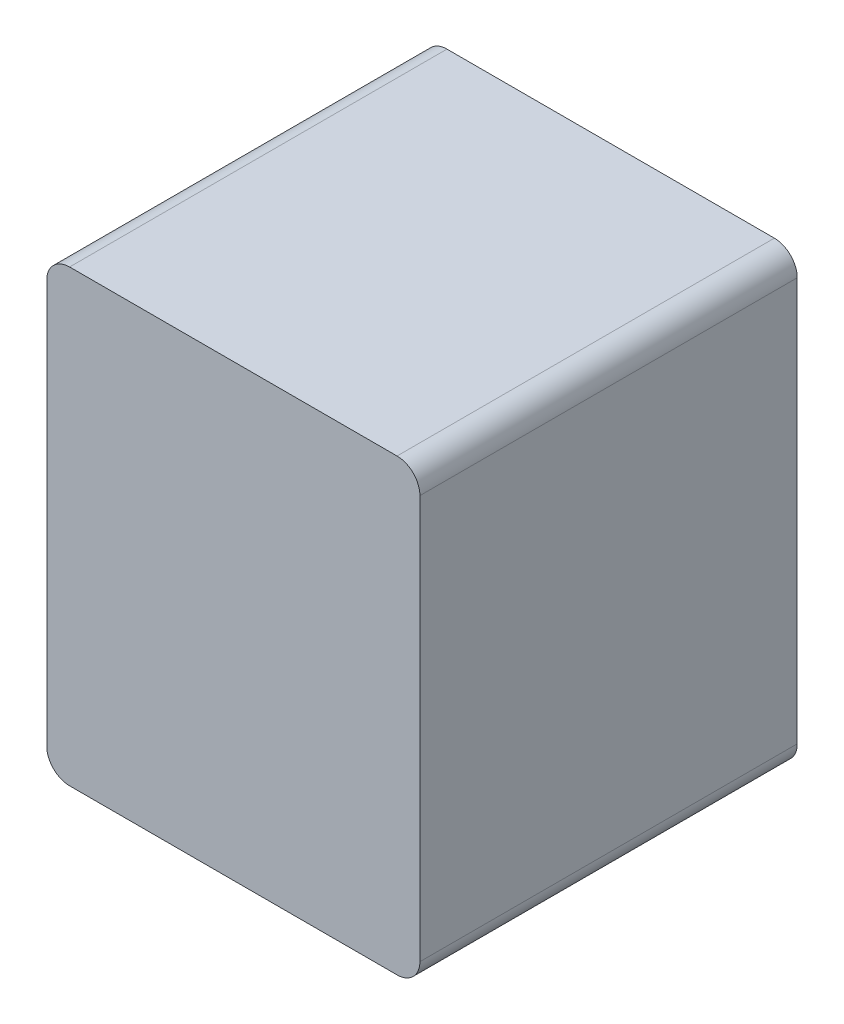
from build123d import *

# Parameters (mm, degrees)
LINEAR_AUSTRAGEN1_DEPTH = 990


with BuildPart() as part:
    # Skizze2 → Linear austragen1 (new body)
    with BuildSketch(Plane.XY):
        with BuildLine():
            Line((-429.5, -1189.5), (429.5, -1189.5))
            ThreePointArc((429.5, -1189.5), (471.926406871, -1171.926406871), (489.5, -1129.5))
            Line((489.5, -1129.5), (489.5, -70.5))
            ThreePointArc((489.5, -70.5), (471.926406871, -28.073593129), (429.5, -10.5))
            Line((429.5, -10.5), (0, -10.5))
            Line((0, -10.5), (-429.5, -10.5))
            ThreePointArc((-429.5, -10.5), (-471.926406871, -28.073593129), (-489.5, -70.5))
            Line((-489.5, -70.5), (-489.5, -1129.5))
            ThreePointArc((-489.5, -1129.5), (-471.926406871, -1171.926406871), (-429.5, -1189.5))
        make_face()
    extrude(amount=LINEAR_AUSTRAGEN1_DEPTH)


solid = part.part
